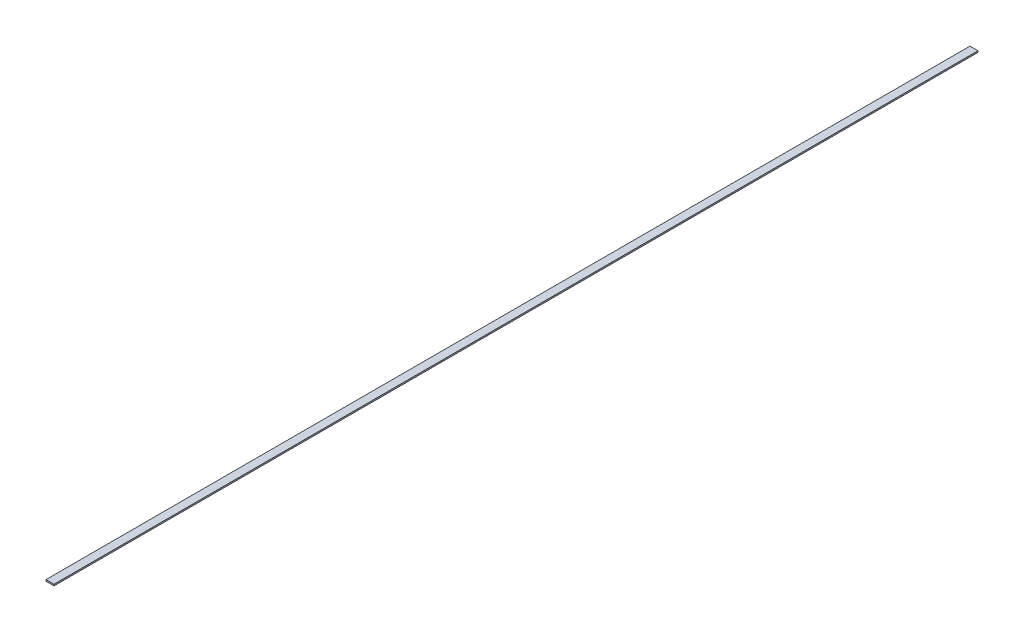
ISO-10303-21;
HEADER;
FILE_DESCRIPTION(('STEP AP214'),'2;1');
FILE_NAME('part.step','',(''),(''),'','','');
FILE_SCHEMA(('AUTOMOTIVE_DESIGN { 1 0 10303 214 1 1 1 1 }'));
ENDSEC;
DATA;
#1=APPLICATION_CONTEXT('core data for automotive mechanical design processes');
#2=APPLICATION_PROTOCOL_DEFINITION('international standard','automotive_design',2000,#1);
#3=PRODUCT_CONTEXT('',#1,'mechanical');
#4=PRODUCT('Part','Part','',(#3));
#5=PRODUCT_RELATED_PRODUCT_CATEGORY('part','',(#4));
#6=PRODUCT_DEFINITION_FORMATION('','',#4);
#7=PRODUCT_DEFINITION_CONTEXT('part definition',#1,'design');
#8=PRODUCT_DEFINITION('design','',#6,#7);
#9=PRODUCT_DEFINITION_SHAPE('','',#8);
#10=(LENGTH_UNIT() NAMED_UNIT(*) SI_UNIT(.MILLI.,.METRE.));
#11=(NAMED_UNIT(*) PLANE_ANGLE_UNIT() SI_UNIT($,.RADIAN.));
#12=(NAMED_UNIT(*) SI_UNIT($,.STERADIAN.) SOLID_ANGLE_UNIT());
#13=UNCERTAINTY_MEASURE_WITH_UNIT(LENGTH_MEASURE(1.E-05),#10,'distance_accuracy_value','');
#14=(GEOMETRIC_REPRESENTATION_CONTEXT(3) GLOBAL_UNCERTAINTY_ASSIGNED_CONTEXT((#13)) GLOBAL_UNIT_ASSIGNED_CONTEXT((#10,
#11,#12)) REPRESENTATION_CONTEXT('',''));
#15=CARTESIAN_POINT('',(0.,0.,0.));
#16=DIRECTION('',(0.,0.,1.));
#17=DIRECTION('',(1.,0.,0.));
#18=AXIS2_PLACEMENT_3D('',#15,#16,#17);
#19=CARTESIAN_POINT('',(-3.96875,0.7239,457.2));
#20=DIRECTION('',(1.,0.,0.));
#21=DIRECTION('',(0.,0.,-1.));
#22=AXIS2_PLACEMENT_3D('',#19,#20,#21);
#23=PLANE('',#22);
#24=DIRECTION('',(0.,-1.,0.));
#25=VECTOR('',#24,1.);
#26=CARTESIAN_POINT('',(-3.96875,0.7239,-457.2));
#27=LINE('',#26,#25);
#28=CARTESIAN_POINT('',(-3.96875,0.7239,-457.2));
#29=VERTEX_POINT('',#28);
#30=CARTESIAN_POINT('',(-3.96875,-0.7239,-457.2));
#31=VERTEX_POINT('',#30);
#32=EDGE_CURVE('E93',#29,#31,#27,.T.);
#33=ORIENTED_EDGE('',*,*,#32,.T.);
#34=DIRECTION('',(0.,0.,-1.));
#35=VECTOR('',#34,1.);
#36=CARTESIAN_POINT('',(-3.96875,-0.7239,457.2));
#37=LINE('',#36,#35);
#38=CARTESIAN_POINT('',(-3.96875,-0.7239,457.2));
#39=VERTEX_POINT('',#38);
#40=EDGE_CURVE('E11',#39,#31,#37,.T.);
#41=ORIENTED_EDGE('',*,*,#40,.F.);
#42=DIRECTION('',(0.,-1.,0.));
#43=VECTOR('',#42,1.);
#44=CARTESIAN_POINT('',(-3.96875,0.7239,457.2));
#45=LINE('',#44,#43);
#46=CARTESIAN_POINT('',(-3.96875,0.7239,457.2));
#47=VERTEX_POINT('',#46);
#48=EDGE_CURVE('E81',#47,#39,#45,.T.);
#49=ORIENTED_EDGE('',*,*,#48,.F.);
#50=DIRECTION('',(0.,0.,-1.));
#51=VECTOR('',#50,1.);
#52=CARTESIAN_POINT('',(-3.96875,0.7239,457.2));
#53=LINE('',#52,#51);
#54=EDGE_CURVE('E89',#47,#29,#53,.T.);
#55=ORIENTED_EDGE('',*,*,#54,.T.);
#56=EDGE_LOOP('',(#33,#41,#49,#55));
#57=FACE_BOUND('',#56,.T.);
#58=ADVANCED_FACE('F30',(#57),#23,.F.);
#59=CARTESIAN_POINT('',(-3.96875,-0.7239,457.2));
#60=DIRECTION('',(0.,1.,0.));
#61=DIRECTION('',(-1.,0.,0.));
#62=AXIS2_PLACEMENT_3D('',#59,#60,#61);
#63=PLANE('',#62);
#64=DIRECTION('',(1.,0.,0.));
#65=VECTOR('',#64,1.);
#66=CARTESIAN_POINT('',(-3.96875,-0.7239,-457.2));
#67=LINE('',#66,#65);
#68=CARTESIAN_POINT('',(3.96875,-0.723899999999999,-457.2));
#69=VERTEX_POINT('',#68);
#70=EDGE_CURVE('E85',#31,#69,#67,.T.);
#71=ORIENTED_EDGE('',*,*,#70,.T.);
#72=DIRECTION('',(0.,0.,-1.));
#73=VECTOR('',#72,1.);
#74=CARTESIAN_POINT('',(3.96875,-0.723899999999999,457.2));
#75=LINE('',#74,#73);
#76=CARTESIAN_POINT('',(3.96875,-0.723899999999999,457.2));
#77=VERTEX_POINT('',#76);
#78=EDGE_CURVE('E38',#77,#69,#75,.T.);
#79=ORIENTED_EDGE('',*,*,#78,.F.);
#80=DIRECTION('',(1.,0.,0.));
#81=VECTOR('',#80,1.);
#82=CARTESIAN_POINT('',(-3.96875,-0.7239,457.2));
#83=LINE('',#82,#81);
#84=EDGE_CURVE('E76',#39,#77,#83,.T.);
#85=ORIENTED_EDGE('',*,*,#84,.F.);
#86=ORIENTED_EDGE('',*,*,#40,.T.);
#87=EDGE_LOOP('',(#71,#79,#85,#86));
#88=FACE_BOUND('',#87,.T.);
#89=ADVANCED_FACE('F84',(#88),#63,.F.);
#90=CARTESIAN_POINT('',(3.96875,0.723899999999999,457.2));
#91=DIRECTION('',(-1.,0.,0.));
#92=DIRECTION('',(0.,0.,1.));
#93=AXIS2_PLACEMENT_3D('',#90,#91,#92);
#94=PLANE('',#93);
#95=DIRECTION('',(0.,1.,0.));
#96=VECTOR('',#95,1.);
#97=CARTESIAN_POINT('',(3.96875,0.723899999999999,-457.2));
#98=LINE('',#97,#96);
#99=CARTESIAN_POINT('',(3.96875,0.723899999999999,-457.2));
#100=VERTEX_POINT('',#99);
#101=EDGE_CURVE('E63',#69,#100,#98,.T.);
#102=ORIENTED_EDGE('',*,*,#101,.T.);
#103=DIRECTION('',(0.,0.,-1.));
#104=VECTOR('',#103,1.);
#105=CARTESIAN_POINT('',(3.96875,0.723899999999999,457.2));
#106=LINE('',#105,#104);
#107=CARTESIAN_POINT('',(3.96875,0.723899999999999,457.2));
#108=VERTEX_POINT('',#107);
#109=EDGE_CURVE('E86',#108,#100,#106,.T.);
#110=ORIENTED_EDGE('',*,*,#109,.F.);
#111=DIRECTION('',(0.,1.,0.));
#112=VECTOR('',#111,1.);
#113=CARTESIAN_POINT('',(3.96875,0.723899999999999,457.2));
#114=LINE('',#113,#112);
#115=EDGE_CURVE('E79',#77,#108,#114,.T.);
#116=ORIENTED_EDGE('',*,*,#115,.F.);
#117=ORIENTED_EDGE('',*,*,#78,.T.);
#118=EDGE_LOOP('',(#102,#110,#116,#117));
#119=FACE_BOUND('',#118,.T.);
#120=ADVANCED_FACE('F87',(#119),#94,.F.);
#121=CARTESIAN_POINT('',(-3.96875,0.7239,457.2));
#122=DIRECTION('',(0.,-1.,0.));
#123=DIRECTION('',(1.,0.,0.));
#124=AXIS2_PLACEMENT_3D('',#121,#122,#123);
#125=PLANE('',#124);
#126=DIRECTION('',(-1.,0.,0.));
#127=VECTOR('',#126,1.);
#128=CARTESIAN_POINT('',(-3.96875,0.7239,-457.2));
#129=LINE('',#128,#127);
#130=EDGE_CURVE('E69',#100,#29,#129,.T.);
#131=ORIENTED_EDGE('',*,*,#130,.T.);
#132=ORIENTED_EDGE('',*,*,#54,.F.);
#133=DIRECTION('',(-1.,0.,0.));
#134=VECTOR('',#133,1.);
#135=CARTESIAN_POINT('',(-3.96875,0.7239,457.2));
#136=LINE('',#135,#134);
#137=EDGE_CURVE('E46',#108,#47,#136,.T.);
#138=ORIENTED_EDGE('',*,*,#137,.F.);
#139=ORIENTED_EDGE('',*,*,#109,.T.);
#140=EDGE_LOOP('',(#131,#132,#138,#139));
#141=FACE_BOUND('',#140,.T.);
#142=ADVANCED_FACE('F100',(#141),#125,.F.);
#143=CARTESIAN_POINT('',(-3.96875,-0.7239,457.2));
#144=DIRECTION('',(0.,0.,1.));
#145=DIRECTION('',(1.,0.,0.));
#146=AXIS2_PLACEMENT_3D('',#143,#144,#145);
#147=PLANE('',#146);
#148=ORIENTED_EDGE('',*,*,#48,.T.);
#149=ORIENTED_EDGE('',*,*,#84,.T.);
#150=ORIENTED_EDGE('',*,*,#115,.T.);
#151=ORIENTED_EDGE('',*,*,#137,.T.);
#152=EDGE_LOOP('',(#148,#149,#150,#151));
#153=FACE_BOUND('',#152,.T.);
#154=ADVANCED_FACE('F77',(#153),#147,.T.);
#155=CARTESIAN_POINT('',(-3.96875,-0.7239,-457.2));
#156=DIRECTION('',(0.,0.,1.));
#157=DIRECTION('',(1.,0.,0.));
#158=AXIS2_PLACEMENT_3D('',#155,#156,#157);
#159=PLANE('',#158);
#160=ORIENTED_EDGE('',*,*,#32,.F.);
#161=ORIENTED_EDGE('',*,*,#130,.F.);
#162=ORIENTED_EDGE('',*,*,#101,.F.);
#163=ORIENTED_EDGE('',*,*,#70,.F.);
#164=EDGE_LOOP('',(#160,#161,#162,#163));
#165=FACE_BOUND('',#164,.T.);
#166=ADVANCED_FACE('F103',(#165),#159,.F.);
#167=CLOSED_SHELL('',(#58,#89,#120,#142,#154,#166));
#168=MANIFOLD_SOLID_BREP('B2',#167);
#169=ADVANCED_BREP_SHAPE_REPRESENTATION('',(#18,#168),#14);
#170=SHAPE_DEFINITION_REPRESENTATION(#9,#169);
ENDSEC;
END-ISO-10303-21;
